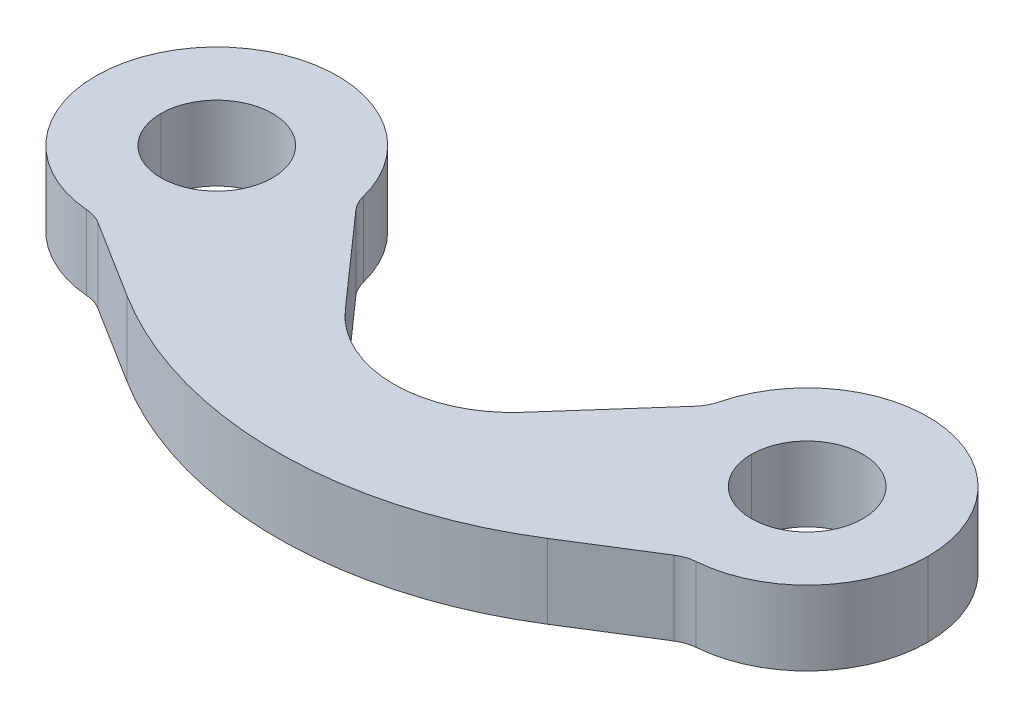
ISO-10303-21;
HEADER;
FILE_DESCRIPTION(('STEP AP214'),'2;1');
FILE_NAME('part.step','',(''),(''),'','','');
FILE_SCHEMA(('AUTOMOTIVE_DESIGN { 1 0 10303 214 1 1 1 1 }'));
ENDSEC;
DATA;
#1=APPLICATION_CONTEXT('core data for automotive mechanical design processes');
#2=APPLICATION_PROTOCOL_DEFINITION('international standard','automotive_design',2000,#1);
#3=PRODUCT_CONTEXT('',#1,'mechanical');
#4=PRODUCT('Part','Part','',(#3));
#5=PRODUCT_RELATED_PRODUCT_CATEGORY('part','',(#4));
#6=PRODUCT_DEFINITION_FORMATION('','',#4);
#7=PRODUCT_DEFINITION_CONTEXT('part definition',#1,'design');
#8=PRODUCT_DEFINITION('design','',#6,#7);
#9=PRODUCT_DEFINITION_SHAPE('','',#8);
#10=(LENGTH_UNIT() NAMED_UNIT(*) SI_UNIT(.MILLI.,.METRE.));
#11=(NAMED_UNIT(*) PLANE_ANGLE_UNIT() SI_UNIT($,.RADIAN.));
#12=(NAMED_UNIT(*) SI_UNIT($,.STERADIAN.) SOLID_ANGLE_UNIT());
#13=UNCERTAINTY_MEASURE_WITH_UNIT(LENGTH_MEASURE(1.E-05),#10,'distance_accuracy_value','');
#14=(GEOMETRIC_REPRESENTATION_CONTEXT(3) GLOBAL_UNCERTAINTY_ASSIGNED_CONTEXT((#13)) GLOBAL_UNIT_ASSIGNED_CONTEXT((#10,
#11,#12)) REPRESENTATION_CONTEXT('',''));
#15=CARTESIAN_POINT('',(0.,0.,0.));
#16=DIRECTION('',(0.,0.,1.));
#17=DIRECTION('',(1.,0.,0.));
#18=AXIS2_PLACEMENT_3D('',#15,#16,#17);
#19=CARTESIAN_POINT('',(0.,0.999999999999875,0.));
#20=DIRECTION('',(0.,-1.,0.));
#21=DIRECTION('',(1.,0.,0.));
#22=AXIS2_PLACEMENT_3D('',#19,#20,#21);
#23=CYLINDRICAL_SURFACE('',#22,1.50000000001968);
#24=CARTESIAN_POINT('',(0.,0.999999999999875,0.));
#25=DIRECTION('',(0.,-1.,0.));
#26=DIRECTION('',(1.,0.,0.));
#27=AXIS2_PLACEMENT_3D('',#24,#25,#26);
#28=CIRCLE('',#27,1.50000000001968);
#29=CARTESIAN_POINT('',(-1.50000000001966,0.999999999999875,0.));
#30=VERTEX_POINT('',#29);
#31=CARTESIAN_POINT('',(1.50000000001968,0.999999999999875,0.));
#32=VERTEX_POINT('',#31);
#33=EDGE_CURVE('E41',#30,#32,#28,.T.);
#34=ORIENTED_EDGE('',*,*,#33,.F.);
#35=DIRECTION('',(0.,-1.,0.));
#36=VECTOR('',#35,1.);
#37=CARTESIAN_POINT('',(-1.50000000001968,0.999999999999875,0.));
#38=LINE('',#37,#36);
#39=CARTESIAN_POINT('',(-1.50000000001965,-1.00000000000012,0.));
#40=VERTEX_POINT('',#39);
#41=EDGE_CURVE('E11',#30,#40,#38,.T.);
#42=ORIENTED_EDGE('',*,*,#41,.T.);
#43=CARTESIAN_POINT('',(0.,-1.00000000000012,0.));
#44=DIRECTION('',(0.,-1.,0.));
#45=DIRECTION('',(1.,0.,0.));
#46=AXIS2_PLACEMENT_3D('',#43,#44,#45);
#47=CIRCLE('',#46,1.50000000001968);
#48=CARTESIAN_POINT('',(1.50000000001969,-1.00000000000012,0.));
#49=VERTEX_POINT('',#48);
#50=EDGE_CURVE('E27',#40,#49,#47,.T.);
#51=ORIENTED_EDGE('',*,*,#50,.T.);
#52=DIRECTION('',(0.,-1.,0.));
#53=VECTOR('',#52,1.);
#54=CARTESIAN_POINT('',(1.50000000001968,0.999999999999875,0.));
#55=LINE('',#54,#53);
#56=EDGE_CURVE('E116',#32,#49,#55,.T.);
#57=ORIENTED_EDGE('',*,*,#56,.F.);
#58=EDGE_LOOP('',(#34,#42,#51,#57));
#59=FACE_BOUND('',#58,.T.);
#60=ADVANCED_FACE('F17',(#59),#23,.F.);
#61=CARTESIAN_POINT('',(15.8750000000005,0.99999999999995,1.59594559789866E-13));
#62=DIRECTION('',(0.,-1.,0.));
#63=DIRECTION('',(1.,0.,0.));
#64=AXIS2_PLACEMENT_3D('',#61,#62,#63);
#65=CYLINDRICAL_SURFACE('',#64,1.50000000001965);
#66=CARTESIAN_POINT('',(15.8750000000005,0.99999999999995,1.59594559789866E-13));
#67=DIRECTION('',(0.,-1.,0.));
#68=DIRECTION('',(1.,0.,0.));
#69=AXIS2_PLACEMENT_3D('',#66,#67,#68);
#70=CIRCLE('',#69,1.50000000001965);
#71=CARTESIAN_POINT('',(14.3749999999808,0.99999999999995,1.59594559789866E-13));
#72=VERTEX_POINT('',#71);
#73=CARTESIAN_POINT('',(17.3750000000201,0.99999999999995,1.59594559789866E-13));
#74=VERTEX_POINT('',#73);
#75=EDGE_CURVE('E131',#72,#74,#70,.T.);
#76=ORIENTED_EDGE('',*,*,#75,.F.);
#77=DIRECTION('',(0.,-1.,0.));
#78=VECTOR('',#77,1.);
#79=CARTESIAN_POINT('',(14.3749999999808,0.99999999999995,1.59594559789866E-13));
#80=LINE('',#79,#78);
#81=CARTESIAN_POINT('',(14.3749999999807,-1.00000000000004,1.59594559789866E-13));
#82=VERTEX_POINT('',#81);
#83=EDGE_CURVE('E303',#72,#82,#80,.T.);
#84=ORIENTED_EDGE('',*,*,#83,.T.);
#85=CARTESIAN_POINT('',(15.8750000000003,-1.00000000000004,0.));
#86=DIRECTION('',(0.,-1.,0.));
#87=DIRECTION('',(1.,0.,0.));
#88=AXIS2_PLACEMENT_3D('',#85,#86,#87);
#89=CIRCLE('',#88,1.50000000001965);
#90=CARTESIAN_POINT('',(17.37500000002,-1.00000000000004,0.));
#91=VERTEX_POINT('',#90);
#92=EDGE_CURVE('E237',#82,#91,#89,.T.);
#93=ORIENTED_EDGE('',*,*,#92,.T.);
#94=DIRECTION('',(0.,-1.,0.));
#95=VECTOR('',#94,1.);
#96=CARTESIAN_POINT('',(17.3750000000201,0.99999999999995,1.59594559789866E-13));
#97=LINE('',#96,#95);
#98=EDGE_CURVE('E282',#74,#91,#97,.T.);
#99=ORIENTED_EDGE('',*,*,#98,.F.);
#100=EDGE_LOOP('',(#76,#84,#93,#99));
#101=FACE_BOUND('',#100,.T.);
#102=ADVANCED_FACE('F543',(#101),#65,.F.);
#103=CARTESIAN_POINT('',(15.8750000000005,0.99999999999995,1.59594559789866E-13));
#104=DIRECTION('',(0.,-1.,0.));
#105=DIRECTION('',(1.,0.,0.));
#106=AXIS2_PLACEMENT_3D('',#103,#104,#105);
#107=CYLINDRICAL_SURFACE('',#106,3.25);
#108=CARTESIAN_POINT('',(15.8750000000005,0.99999999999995,1.59594559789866E-13));
#109=DIRECTION('',(0.,-1.,0.));
#110=DIRECTION('',(1.,0.,0.));
#111=AXIS2_PLACEMENT_3D('',#108,#109,#110);
#112=CIRCLE('',#111,3.25);
#113=CARTESIAN_POINT('',(12.721244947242,1.00000000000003,-0.785066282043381));
#114=VERTEX_POINT('',#113);
#115=CARTESIAN_POINT('',(19.1250000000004,0.99999999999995,1.59594559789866E-13));
#116=VERTEX_POINT('',#115);
#117=EDGE_CURVE('E314',#114,#116,#112,.T.);
#118=ORIENTED_EDGE('',*,*,#117,.T.);
#119=DIRECTION('',(0.,-1.,0.));
#120=VECTOR('',#119,1.);
#121=CARTESIAN_POINT('',(19.1250000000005,0.99999999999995,1.59594559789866E-13));
#122=LINE('',#121,#120);
#123=CARTESIAN_POINT('',(19.1250000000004,-1.00000000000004,1.59594559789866E-13));
#124=VERTEX_POINT('',#123);
#125=EDGE_CURVE('E215',#116,#124,#122,.T.);
#126=ORIENTED_EDGE('',*,*,#125,.T.);
#127=CARTESIAN_POINT('',(15.8750000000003,-1.00000000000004,0.));
#128=DIRECTION('',(0.,-1.,0.));
#129=DIRECTION('',(1.,0.,0.));
#130=AXIS2_PLACEMENT_3D('',#127,#128,#129);
#131=CIRCLE('',#130,3.25);
#132=CARTESIAN_POINT('',(12.721244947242,-0.999999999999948,-0.78506628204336));
#133=VERTEX_POINT('',#132);
#134=EDGE_CURVE('E206',#133,#124,#131,.T.);
#135=ORIENTED_EDGE('',*,*,#134,.F.);
#136=DIRECTION('',(0.,-1.,0.));
#137=VECTOR('',#136,1.);
#138=CARTESIAN_POINT('',(12.721244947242,1.00000000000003,-0.785066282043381));
#139=LINE('',#138,#137);
#140=EDGE_CURVE('E20',#114,#133,#139,.T.);
#141=ORIENTED_EDGE('',*,*,#140,.F.);
#142=EDGE_LOOP('',(#118,#126,#135,#141));
#143=FACE_BOUND('',#142,.T.);
#144=ADVANCED_FACE('F213',(#143),#107,.T.);
#145=CARTESIAN_POINT('',(16.2114974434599,1.,4.23665781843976));
#146=DIRECTION('',(0.,-1.,0.));
#147=DIRECTION('',(1.,0.,0.));
#148=AXIS2_PLACEMENT_3D('',#145,#146,#147);
#149=CYLINDRICAL_SURFACE('',#148,1.00000000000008);
#150=CARTESIAN_POINT('',(16.21149744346,-0.999999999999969,4.23665781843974));
#151=DIRECTION('',(0.,1.,0.));
#152=DIRECTION('',(1.,0.,0.));
#153=AXIS2_PLACEMENT_3D('',#150,#151,#152);
#154=CIRCLE('',#153,1.00000000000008);
#155=CARTESIAN_POINT('',(16.1323215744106,-1.00000000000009,3.23979715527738));
#156=VERTEX_POINT('',#155);
#157=CARTESIAN_POINT('',(15.6804523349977,-0.999999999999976,3.38931426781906));
#158=VERTEX_POINT('',#157);
#159=EDGE_CURVE('E299',#156,#158,#154,.T.);
#160=ORIENTED_EDGE('',*,*,#159,.F.);
#161=DIRECTION('',(0.,-1.,0.));
#162=VECTOR('',#161,1.);
#163=CARTESIAN_POINT('',(16.1323215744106,0.999999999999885,3.2397971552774));
#164=LINE('',#163,#162);
#165=CARTESIAN_POINT('',(16.1323215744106,0.999999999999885,3.2397971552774));
#166=VERTEX_POINT('',#165);
#167=EDGE_CURVE('E266',#166,#156,#164,.T.);
#168=ORIENTED_EDGE('',*,*,#167,.F.);
#169=CARTESIAN_POINT('',(16.2114974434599,1.,4.23665781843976));
#170=DIRECTION('',(0.,1.,0.));
#171=DIRECTION('',(1.,0.,0.));
#172=AXIS2_PLACEMENT_3D('',#169,#170,#171);
#173=CIRCLE('',#172,1.00000000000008);
#174=CARTESIAN_POINT('',(15.6804523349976,1.,3.38931426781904));
#175=VERTEX_POINT('',#174);
#176=EDGE_CURVE('E273',#166,#175,#173,.T.);
#177=ORIENTED_EDGE('',*,*,#176,.T.);
#178=DIRECTION('',(0.,-1.,0.));
#179=VECTOR('',#178,1.);
#180=CARTESIAN_POINT('',(15.6804523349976,1.,3.38931426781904));
#181=LINE('',#180,#179);
#182=EDGE_CURVE('E265',#175,#158,#181,.T.);
#183=ORIENTED_EDGE('',*,*,#182,.T.);
#184=EDGE_LOOP('',(#160,#168,#177,#183));
#185=FACE_BOUND('',#184,.T.);
#186=ADVANCED_FACE('F380',(#185),#149,.F.);
#187=CARTESIAN_POINT('',(15.8750000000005,0.99999999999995,1.59594559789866E-13));
#188=DIRECTION('',(0.,-1.,0.));
#189=DIRECTION('',(1.,0.,0.));
#190=AXIS2_PLACEMENT_3D('',#187,#188,#189);
#191=CYLINDRICAL_SURFACE('',#190,3.25);
#192=ORIENTED_EDGE('',*,*,#125,.F.);
#193=CARTESIAN_POINT('',(15.8750000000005,0.99999999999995,1.59594559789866E-13));
#194=DIRECTION('',(0.,-1.,0.));
#195=DIRECTION('',(1.,0.,0.));
#196=AXIS2_PLACEMENT_3D('',#193,#194,#195);
#197=CIRCLE('',#196,3.25);
#198=EDGE_CURVE('E261',#116,#166,#197,.T.);
#199=ORIENTED_EDGE('',*,*,#198,.T.);
#200=ORIENTED_EDGE('',*,*,#167,.T.);
#201=CARTESIAN_POINT('',(15.8750000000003,-1.00000000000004,0.));
#202=DIRECTION('',(0.,-1.,0.));
#203=DIRECTION('',(1.,0.,0.));
#204=AXIS2_PLACEMENT_3D('',#201,#202,#203);
#205=CIRCLE('',#204,3.25);
#206=EDGE_CURVE('E219',#124,#156,#205,.T.);
#207=ORIENTED_EDGE('',*,*,#206,.F.);
#208=EDGE_LOOP('',(#192,#199,#200,#207));
#209=FACE_BOUND('',#208,.T.);
#210=ADVANCED_FACE('F373',(#209),#191,.T.);
#211=CARTESIAN_POINT('',(11.7508587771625,0.999999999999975,-1.02662513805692));
#212=DIRECTION('',(0.,-1.,0.));
#213=DIRECTION('',(1.,0.,0.));
#214=AXIS2_PLACEMENT_3D('',#211,#212,#213);
#215=CYLINDRICAL_SURFACE('',#214,1.00000000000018);
#216=CARTESIAN_POINT('',(11.7508587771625,-0.999999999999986,-1.02662513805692));
#217=DIRECTION('',(0.,1.,0.));
#218=DIRECTION('',(1.,0.,0.));
#219=AXIS2_PLACEMENT_3D('',#216,#217,#218);
#220=CIRCLE('',#219,1.00000000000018);
#221=CARTESIAN_POINT('',(12.4996587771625,-1.00000000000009,-0.36382912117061));
#222=VERTEX_POINT('',#221);
#223=EDGE_CURVE('E218',#222,#133,#220,.T.);
#224=ORIENTED_EDGE('',*,*,#223,.F.);
#225=DIRECTION('',(0.,-1.,0.));
#226=VECTOR('',#225,1.);
#227=CARTESIAN_POINT('',(12.4996587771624,0.999999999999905,-0.36382912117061));
#228=LINE('',#227,#226);
#229=CARTESIAN_POINT('',(12.4996587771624,0.999999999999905,-0.36382912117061));
#230=VERTEX_POINT('',#229);
#231=EDGE_CURVE('E88',#230,#222,#228,.T.);
#232=ORIENTED_EDGE('',*,*,#231,.F.);
#233=CARTESIAN_POINT('',(11.7508587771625,0.999999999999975,-1.02662513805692));
#234=DIRECTION('',(0.,1.,0.));
#235=DIRECTION('',(1.,0.,0.));
#236=AXIS2_PLACEMENT_3D('',#233,#234,#235);
#237=CIRCLE('',#236,1.00000000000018);
#238=EDGE_CURVE('E222',#230,#114,#237,.T.);
#239=ORIENTED_EDGE('',*,*,#238,.T.);
#240=ORIENTED_EDGE('',*,*,#140,.T.);
#241=EDGE_LOOP('',(#224,#232,#239,#240));
#242=FACE_BOUND('',#241,.T.);
#243=ADVANCED_FACE('F221',(#242),#215,.F.);
#244=CARTESIAN_POINT('',(12.4996587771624,0.999999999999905,-0.36382912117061));
#245=DIRECTION('',(-0.7488,0.,-0.662796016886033));
#246=DIRECTION('',(-0.662796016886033,0.,0.7488));
#247=AXIS2_PLACEMENT_3D('',#244,#245,#246);
#248=PLANE('',#247);
#249=DIRECTION('',(0.662796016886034,0.,-0.7488));
#250=VECTOR('',#249,1.);
#251=CARTESIAN_POINT('',(12.4996587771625,-1.00000000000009,-0.36382912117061));
#252=LINE('',#251,#250);
#253=CARTESIAN_POINT('',(10.3149400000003,-1.,2.10437735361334));
#254=VERTEX_POINT('',#253);
#255=EDGE_CURVE('E75',#254,#222,#252,.T.);
#256=ORIENTED_EDGE('',*,*,#255,.F.);
#257=DIRECTION('',(0.,-1.,0.));
#258=VECTOR('',#257,1.);
#259=CARTESIAN_POINT('',(10.3149400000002,1.,2.10437735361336));
#260=LINE('',#259,#258);
#261=CARTESIAN_POINT('',(10.3149400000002,1.,2.10437735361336));
#262=VERTEX_POINT('',#261);
#263=EDGE_CURVE('E241',#262,#254,#260,.T.);
#264=ORIENTED_EDGE('',*,*,#263,.F.);
#265=DIRECTION('',(0.662796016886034,0.,-0.7488));
#266=VECTOR('',#265,1.);
#267=CARTESIAN_POINT('',(12.4996587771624,0.999999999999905,-0.36382912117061));
#268=LINE('',#267,#266);
#269=EDGE_CURVE('E224',#262,#230,#268,.T.);
#270=ORIENTED_EDGE('',*,*,#269,.T.);
#271=ORIENTED_EDGE('',*,*,#231,.T.);
#272=EDGE_LOOP('',(#256,#264,#270,#271));
#273=FACE_BOUND('',#272,.T.);
#274=ADVANCED_FACE('F567',(#273),#248,.T.);
#275=CARTESIAN_POINT('',(7.93750000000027,0.99999999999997,0.));
#276=DIRECTION('',(0.,-1.,0.));
#277=DIRECTION('',(1.,0.,0.));
#278=AXIS2_PLACEMENT_3D('',#275,#276,#277);
#279=CYLINDRICAL_SURFACE('',#278,3.17500000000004);
#280=CARTESIAN_POINT('',(7.93750000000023,-1.00000000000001,0.));
#281=DIRECTION('',(0.,1.,0.));
#282=DIRECTION('',(1.,0.,0.));
#283=AXIS2_PLACEMENT_3D('',#280,#281,#282);
#284=CIRCLE('',#283,3.17500000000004);
#285=CARTESIAN_POINT('',(5.56006000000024,-0.999999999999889,2.10437735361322));
#286=VERTEX_POINT('',#285);
#287=EDGE_CURVE('E162',#286,#254,#284,.T.);
#288=ORIENTED_EDGE('',*,*,#287,.F.);
#289=DIRECTION('',(0.,-1.,0.));
#290=VECTOR('',#289,1.);
#291=CARTESIAN_POINT('',(5.56006000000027,1.0000000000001,2.10437735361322));
#292=LINE('',#291,#290);
#293=CARTESIAN_POINT('',(5.56006000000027,1.0000000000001,2.10437735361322));
#294=VERTEX_POINT('',#293);
#295=EDGE_CURVE('E169',#294,#286,#292,.T.);
#296=ORIENTED_EDGE('',*,*,#295,.F.);
#297=CARTESIAN_POINT('',(7.93750000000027,0.99999999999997,0.));
#298=DIRECTION('',(0.,1.,0.));
#299=DIRECTION('',(1.,0.,0.));
#300=AXIS2_PLACEMENT_3D('',#297,#298,#299);
#301=CIRCLE('',#300,3.17500000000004);
#302=EDGE_CURVE('E239',#294,#262,#301,.T.);
#303=ORIENTED_EDGE('',*,*,#302,.T.);
#304=ORIENTED_EDGE('',*,*,#263,.T.);
#305=EDGE_LOOP('',(#288,#296,#303,#304));
#306=FACE_BOUND('',#305,.T.);
#307=ADVANCED_FACE('F569',(#306),#279,.F.);
#308=CARTESIAN_POINT('',(5.56006000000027,1.0000000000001,2.10437735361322));
#309=DIRECTION('',(0.7488,0.,-0.662796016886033));
#310=DIRECTION('',(0.,1.,0.));
#311=AXIS2_PLACEMENT_3D('',#308,#309,#310);
#312=PLANE('',#311);
#313=DIRECTION('',(0.662796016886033,0.,0.7488));
#314=VECTOR('',#313,1.);
#315=CARTESIAN_POINT('',(5.56006000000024,-0.999999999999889,2.10437735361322));
#316=LINE('',#315,#314);
#317=CARTESIAN_POINT('',(3.37534122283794,-1.,-0.363829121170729));
#318=VERTEX_POINT('',#317);
#319=EDGE_CURVE('E296',#318,#286,#316,.T.);
#320=ORIENTED_EDGE('',*,*,#319,.F.);
#321=DIRECTION('',(0.,-1.,0.));
#322=VECTOR('',#321,1.);
#323=CARTESIAN_POINT('',(3.375341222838,1.,-0.363829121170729));
#324=LINE('',#323,#322);
#325=CARTESIAN_POINT('',(3.375341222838,1.,-0.363829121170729));
#326=VERTEX_POINT('',#325);
#327=EDGE_CURVE('E254',#326,#318,#324,.T.);
#328=ORIENTED_EDGE('',*,*,#327,.F.);
#329=DIRECTION('',(0.662796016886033,0.,0.7488));
#330=VECTOR('',#329,1.);
#331=CARTESIAN_POINT('',(5.56006000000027,1.0000000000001,2.10437735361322));
#332=LINE('',#331,#330);
#333=EDGE_CURVE('E318',#326,#294,#332,.T.);
#334=ORIENTED_EDGE('',*,*,#333,.T.);
#335=ORIENTED_EDGE('',*,*,#295,.T.);
#336=EDGE_LOOP('',(#320,#328,#334,#335));
#337=FACE_BOUND('',#336,.T.);
#338=ADVANCED_FACE('F516',(#337),#312,.T.);
#339=CARTESIAN_POINT('',(4.12414122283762,0.999999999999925,-1.02662513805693));
#340=DIRECTION('',(0.,-1.,0.));
#341=DIRECTION('',(1.,0.,0.));
#342=AXIS2_PLACEMENT_3D('',#339,#340,#341);
#343=CYLINDRICAL_SURFACE('',#342,0.999999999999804);
#344=CARTESIAN_POINT('',(4.12414122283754,-1.00000000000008,-1.02662513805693));
#345=DIRECTION('',(0.,1.,0.));
#346=DIRECTION('',(1.,0.,0.));
#347=AXIS2_PLACEMENT_3D('',#344,#345,#346);
#348=CIRCLE('',#347,0.999999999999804);
#349=CARTESIAN_POINT('',(3.15375505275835,-0.999999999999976,-0.7850662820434));
#350=VERTEX_POINT('',#349);
#351=EDGE_CURVE('E342',#350,#318,#348,.T.);
#352=ORIENTED_EDGE('',*,*,#351,.F.);
#353=DIRECTION('',(0.,-1.,0.));
#354=VECTOR('',#353,1.);
#355=CARTESIAN_POINT('',(3.15375505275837,1.,-0.785066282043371));
#356=LINE('',#355,#354);
#357=CARTESIAN_POINT('',(3.15375505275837,1.,-0.785066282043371));
#358=VERTEX_POINT('',#357);
#359=EDGE_CURVE('E271',#358,#350,#356,.T.);
#360=ORIENTED_EDGE('',*,*,#359,.F.);
#361=CARTESIAN_POINT('',(4.12414122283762,0.999999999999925,-1.02662513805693));
#362=DIRECTION('',(0.,1.,0.));
#363=DIRECTION('',(1.,0.,0.));
#364=AXIS2_PLACEMENT_3D('',#361,#362,#363);
#365=CIRCLE('',#364,0.999999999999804);
#366=EDGE_CURVE('E250',#358,#326,#365,.T.);
#367=ORIENTED_EDGE('',*,*,#366,.T.);
#368=ORIENTED_EDGE('',*,*,#327,.T.);
#369=EDGE_LOOP('',(#352,#360,#367,#368));
#370=FACE_BOUND('',#369,.T.);
#371=ADVANCED_FACE('F522',(#370),#343,.F.);
#372=CARTESIAN_POINT('',(0.,0.999999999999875,0.));
#373=DIRECTION('',(0.,-1.,0.));
#374=DIRECTION('',(1.,0.,0.));
#375=AXIS2_PLACEMENT_3D('',#372,#373,#374);
#376=CYLINDRICAL_SURFACE('',#375,3.25);
#377=CARTESIAN_POINT('',(0.,-1.00000000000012,0.));
#378=DIRECTION('',(0.,-1.,0.));
#379=DIRECTION('',(1.,0.,0.));
#380=AXIS2_PLACEMENT_3D('',#377,#378,#379);
#381=CIRCLE('',#380,3.25);
#382=CARTESIAN_POINT('',(-0.257321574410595,-0.999999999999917,3.23979715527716));
#383=VERTEX_POINT('',#382);
#384=EDGE_CURVE('E289',#383,#350,#381,.T.);
#385=ORIENTED_EDGE('',*,*,#384,.F.);
#386=DIRECTION('',(0.,-1.,0.));
#387=VECTOR('',#386,1.);
#388=CARTESIAN_POINT('',(-0.257321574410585,1.,3.23979715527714));
#389=LINE('',#388,#387);
#390=CARTESIAN_POINT('',(-0.257321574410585,1.,3.23979715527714));
#391=VERTEX_POINT('',#390);
#392=EDGE_CURVE('E272',#391,#383,#389,.T.);
#393=ORIENTED_EDGE('',*,*,#392,.F.);
#394=CARTESIAN_POINT('',(0.,0.999999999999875,0.));
#395=DIRECTION('',(0.,-1.,0.));
#396=DIRECTION('',(1.,0.,0.));
#397=AXIS2_PLACEMENT_3D('',#394,#395,#396);
#398=CIRCLE('',#397,3.25);
#399=EDGE_CURVE('E338',#391,#358,#398,.T.);
#400=ORIENTED_EDGE('',*,*,#399,.T.);
#401=ORIENTED_EDGE('',*,*,#359,.T.);
#402=EDGE_LOOP('',(#385,#393,#400,#401));
#403=FACE_BOUND('',#402,.T.);
#404=ADVANCED_FACE('F524',(#403),#376,.T.);
#405=CARTESIAN_POINT('',(-0.336497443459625,1.00000000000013,4.2366578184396));
#406=DIRECTION('',(0.,-1.,0.));
#407=DIRECTION('',(1.,0.,0.));
#408=AXIS2_PLACEMENT_3D('',#405,#406,#407);
#409=CYLINDRICAL_SURFACE('',#408,1.);
#410=CARTESIAN_POINT('',(-0.336497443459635,-0.999999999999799,4.2366578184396));
#411=DIRECTION('',(0.,1.,0.));
#412=DIRECTION('',(1.,0.,0.));
#413=AXIS2_PLACEMENT_3D('',#410,#411,#412);
#414=CIRCLE('',#413,1.);
#415=CARTESIAN_POINT('',(0.194547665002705,-0.999999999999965,3.38931426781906));
#416=VERTEX_POINT('',#415);
#417=EDGE_CURVE('E260',#416,#383,#414,.T.);
#418=ORIENTED_EDGE('',*,*,#417,.F.);
#419=DIRECTION('',(0.,-1.,0.));
#420=VECTOR('',#419,1.);
#421=CARTESIAN_POINT('',(0.19454766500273,1.00000000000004,3.3893142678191));
#422=LINE('',#421,#420);
#423=CARTESIAN_POINT('',(0.19454766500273,1.00000000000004,3.3893142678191));
#424=VERTEX_POINT('',#423);
#425=EDGE_CURVE('E321',#424,#416,#422,.T.);
#426=ORIENTED_EDGE('',*,*,#425,.F.);
#427=CARTESIAN_POINT('',(-0.336497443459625,1.00000000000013,4.2366578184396));
#428=DIRECTION('',(0.,1.,0.));
#429=DIRECTION('',(1.,0.,0.));
#430=AXIS2_PLACEMENT_3D('',#427,#428,#429);
#431=CIRCLE('',#430,1.);
#432=EDGE_CURVE('E267',#424,#391,#431,.T.);
#433=ORIENTED_EDGE('',*,*,#432,.T.);
#434=ORIENTED_EDGE('',*,*,#392,.T.);
#435=EDGE_LOOP('',(#418,#426,#433,#434));
#436=FACE_BOUND('',#435,.T.);
#437=ADVANCED_FACE('F526',(#436),#409,.F.);
#438=CARTESIAN_POINT('',(0.19454766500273,1.00000000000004,3.3893142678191));
#439=DIRECTION('',(-0.531045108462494,0.,0.847343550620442));
#440=DIRECTION('',(0.,-1.,0.));
#441=AXIS2_PLACEMENT_3D('',#438,#439,#440);
#442=PLANE('',#441);
#443=DIRECTION('',(-0.847343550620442,0.,-0.531045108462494));
#444=VECTOR('',#443,1.);
#445=CARTESIAN_POINT('',(0.194547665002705,-0.999999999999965,3.38931426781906));
#446=LINE('',#445,#444);
#447=CARTESIAN_POINT('',(2.2857993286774,-1.00000000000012,4.69993847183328));
#448=VERTEX_POINT('',#447);
#449=EDGE_CURVE('E255',#448,#416,#446,.T.);
#450=ORIENTED_EDGE('',*,*,#449,.F.);
#451=DIRECTION('',(0.,-1.,0.));
#452=VECTOR('',#451,1.);
#453=CARTESIAN_POINT('',(2.28579932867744,0.99999999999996,4.69993847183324));
#454=LINE('',#453,#452);
#455=CARTESIAN_POINT('',(2.28579932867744,0.99999999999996,4.69993847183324));
#456=VERTEX_POINT('',#455);
#457=EDGE_CURVE('E367',#456,#448,#454,.T.);
#458=ORIENTED_EDGE('',*,*,#457,.F.);
#459=DIRECTION('',(-0.847343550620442,0.,-0.531045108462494));
#460=VECTOR('',#459,1.);
#461=CARTESIAN_POINT('',(0.19454766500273,1.00000000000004,3.3893142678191));
#462=LINE('',#461,#460);
#463=EDGE_CURVE('E325',#456,#424,#462,.T.);
#464=ORIENTED_EDGE('',*,*,#463,.T.);
#465=ORIENTED_EDGE('',*,*,#425,.T.);
#466=EDGE_LOOP('',(#450,#458,#464,#465));
#467=FACE_BOUND('',#466,.T.);
#468=ADVANCED_FACE('F529',(#467),#442,.T.);
#469=CARTESIAN_POINT('',(7.93750000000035,1.,-4.31800000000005));
#470=DIRECTION('',(0.,-1.,0.));
#471=DIRECTION('',(1.,0.,0.));
#472=AXIS2_PLACEMENT_3D('',#469,#470,#471);
#473=CYLINDRICAL_SURFACE('',#472,10.6426);
#474=CARTESIAN_POINT('',(7.93750000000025,-1.,-4.31800000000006));
#475=DIRECTION('',(0.,-1.,0.));
#476=DIRECTION('',(1.,0.,0.));
#477=AXIS2_PLACEMENT_3D('',#474,#475,#476);
#478=CIRCLE('',#477,10.6426);
#479=CARTESIAN_POINT('',(13.5892006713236,-0.999999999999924,4.69993847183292));
#480=VERTEX_POINT('',#479);
#481=EDGE_CURVE('E259',#480,#448,#478,.T.);
#482=ORIENTED_EDGE('',*,*,#481,.F.);
#483=DIRECTION('',(0.,-1.,0.));
#484=VECTOR('',#483,1.);
#485=CARTESIAN_POINT('',(13.5892006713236,1.00000000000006,4.69993847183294));
#486=LINE('',#485,#484);
#487=CARTESIAN_POINT('',(13.5892006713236,1.00000000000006,4.69993847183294));
#488=VERTEX_POINT('',#487);
#489=EDGE_CURVE('E332',#488,#480,#486,.T.);
#490=ORIENTED_EDGE('',*,*,#489,.F.);
#491=CARTESIAN_POINT('',(7.93750000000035,1.,-4.31800000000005));
#492=DIRECTION('',(0.,-1.,0.));
#493=DIRECTION('',(1.,0.,0.));
#494=AXIS2_PLACEMENT_3D('',#491,#492,#493);
#495=CIRCLE('',#494,10.6426);
#496=EDGE_CURVE('E326',#488,#456,#495,.T.);
#497=ORIENTED_EDGE('',*,*,#496,.T.);
#498=ORIENTED_EDGE('',*,*,#457,.T.);
#499=EDGE_LOOP('',(#482,#490,#497,#498));
#500=FACE_BOUND('',#499,.T.);
#501=ADVANCED_FACE('F531',(#500),#473,.T.);
#502=CARTESIAN_POINT('',(13.5892006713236,1.00000000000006,4.69993847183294));
#503=DIRECTION('',(0.531045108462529,0.,0.847343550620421));
#504=DIRECTION('',(0.,1.,0.));
#505=AXIS2_PLACEMENT_3D('',#502,#503,#504);
#506=PLANE('',#505);
#507=DIRECTION('',(-0.847343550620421,0.,0.531045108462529));
#508=VECTOR('',#507,1.);
#509=CARTESIAN_POINT('',(13.5892006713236,-0.999999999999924,4.69993847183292));
#510=LINE('',#509,#508);
#511=EDGE_CURVE('E292',#158,#480,#510,.T.);
#512=ORIENTED_EDGE('',*,*,#511,.F.);
#513=ORIENTED_EDGE('',*,*,#182,.F.);
#514=DIRECTION('',(-0.847343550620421,0.,0.531045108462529));
#515=VECTOR('',#514,1.);
#516=CARTESIAN_POINT('',(13.5892006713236,1.00000000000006,4.69993847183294));
#517=LINE('',#516,#515);
#518=EDGE_CURVE('E364',#175,#488,#517,.T.);
#519=ORIENTED_EDGE('',*,*,#518,.T.);
#520=ORIENTED_EDGE('',*,*,#489,.T.);
#521=EDGE_LOOP('',(#512,#513,#519,#520));
#522=FACE_BOUND('',#521,.T.);
#523=ADVANCED_FACE('F384',(#522),#506,.T.);
#524=CARTESIAN_POINT('',(16.2114974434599,1.,4.23665781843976));
#525=DIRECTION('',(0.,-1.,0.));
#526=DIRECTION('',(1.,0.,0.));
#527=AXIS2_PLACEMENT_3D('',#524,#525,#526);
#528=PLANE('',#527);
#529=ORIENTED_EDGE('',*,*,#176,.F.);
#530=ORIENTED_EDGE('',*,*,#198,.F.);
#531=ORIENTED_EDGE('',*,*,#117,.F.);
#532=ORIENTED_EDGE('',*,*,#238,.F.);
#533=ORIENTED_EDGE('',*,*,#269,.F.);
#534=ORIENTED_EDGE('',*,*,#302,.F.);
#535=ORIENTED_EDGE('',*,*,#333,.F.);
#536=ORIENTED_EDGE('',*,*,#366,.F.);
#537=ORIENTED_EDGE('',*,*,#399,.F.);
#538=ORIENTED_EDGE('',*,*,#432,.F.);
#539=ORIENTED_EDGE('',*,*,#463,.F.);
#540=ORIENTED_EDGE('',*,*,#496,.F.);
#541=ORIENTED_EDGE('',*,*,#518,.F.);
#542=EDGE_LOOP('',(#529,#530,#531,#532,#533,#534,#535,#536,#537,#538,#539,#540,#541));
#543=FACE_BOUND('',#542,.T.);
#544=CARTESIAN_POINT('',(0.,0.999999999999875,0.));
#545=DIRECTION('',(0.,-1.,0.));
#546=DIRECTION('',(1.,0.,0.));
#547=AXIS2_PLACEMENT_3D('',#544,#545,#546);
#548=CIRCLE('',#547,1.50000000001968);
#549=EDGE_CURVE('E243',#32,#30,#548,.T.);
#550=ORIENTED_EDGE('',*,*,#549,.T.);
#551=ORIENTED_EDGE('',*,*,#33,.T.);
#552=EDGE_LOOP('',(#550,#551));
#553=FACE_BOUND('',#552,.T.);
#554=CARTESIAN_POINT('',(15.8750000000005,0.99999999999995,1.59594559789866E-13));
#555=DIRECTION('',(0.,-1.,0.));
#556=DIRECTION('',(1.,0.,0.));
#557=AXIS2_PLACEMENT_3D('',#554,#555,#556);
#558=CIRCLE('',#557,1.50000000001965);
#559=EDGE_CURVE('E244',#74,#72,#558,.T.);
#560=ORIENTED_EDGE('',*,*,#559,.T.);
#561=ORIENTED_EDGE('',*,*,#75,.T.);
#562=EDGE_LOOP('',(#560,#561));
#563=FACE_BOUND('',#562,.T.);
#564=ADVANCED_FACE('F411',(#543,#553,#563),#528,.F.);
#565=CARTESIAN_POINT('',(16.21149744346,-0.999999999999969,4.23665781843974));
#566=DIRECTION('',(0.,-1.,0.));
#567=DIRECTION('',(1.,0.,0.));
#568=AXIS2_PLACEMENT_3D('',#565,#566,#567);
#569=PLANE('',#568);
#570=ORIENTED_EDGE('',*,*,#159,.T.);
#571=ORIENTED_EDGE('',*,*,#511,.T.);
#572=ORIENTED_EDGE('',*,*,#481,.T.);
#573=ORIENTED_EDGE('',*,*,#449,.T.);
#574=ORIENTED_EDGE('',*,*,#417,.T.);
#575=ORIENTED_EDGE('',*,*,#384,.T.);
#576=ORIENTED_EDGE('',*,*,#351,.T.);
#577=ORIENTED_EDGE('',*,*,#319,.T.);
#578=ORIENTED_EDGE('',*,*,#287,.T.);
#579=ORIENTED_EDGE('',*,*,#255,.T.);
#580=ORIENTED_EDGE('',*,*,#223,.T.);
#581=ORIENTED_EDGE('',*,*,#134,.T.);
#582=ORIENTED_EDGE('',*,*,#206,.T.);
#583=EDGE_LOOP('',(#570,#571,#572,#573,#574,#575,#576,#577,#578,#579,#580,#581,#582));
#584=FACE_BOUND('',#583,.T.);
#585=CARTESIAN_POINT('',(0.,-1.00000000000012,0.));
#586=DIRECTION('',(0.,-1.,0.));
#587=DIRECTION('',(1.,0.,0.));
#588=AXIS2_PLACEMENT_3D('',#585,#586,#587);
#589=CIRCLE('',#588,1.50000000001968);
#590=EDGE_CURVE('E249',#49,#40,#589,.T.);
#591=ORIENTED_EDGE('',*,*,#590,.F.);
#592=ORIENTED_EDGE('',*,*,#50,.F.);
#593=EDGE_LOOP('',(#591,#592));
#594=FACE_BOUND('',#593,.T.);
#595=CARTESIAN_POINT('',(15.8750000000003,-1.00000000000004,0.));
#596=DIRECTION('',(0.,-1.,0.));
#597=DIRECTION('',(1.,0.,0.));
#598=AXIS2_PLACEMENT_3D('',#595,#596,#597);
#599=CIRCLE('',#598,1.50000000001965);
#600=EDGE_CURVE('E248',#91,#82,#599,.T.);
#601=ORIENTED_EDGE('',*,*,#600,.F.);
#602=ORIENTED_EDGE('',*,*,#92,.F.);
#603=EDGE_LOOP('',(#601,#602));
#604=FACE_BOUND('',#603,.T.);
#605=ADVANCED_FACE('F225',(#584,#594,#604),#569,.T.);
#606=CARTESIAN_POINT('',(15.8750000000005,0.99999999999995,1.59594559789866E-13));
#607=DIRECTION('',(0.,-1.,0.));
#608=DIRECTION('',(1.,0.,0.));
#609=AXIS2_PLACEMENT_3D('',#606,#607,#608);
#610=CYLINDRICAL_SURFACE('',#609,1.50000000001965);
#611=ORIENTED_EDGE('',*,*,#83,.F.);
#612=ORIENTED_EDGE('',*,*,#559,.F.);
#613=ORIENTED_EDGE('',*,*,#98,.T.);
#614=ORIENTED_EDGE('',*,*,#600,.T.);
#615=EDGE_LOOP('',(#611,#612,#613,#614));
#616=FACE_BOUND('',#615,.T.);
#617=ADVANCED_FACE('F556',(#616),#610,.F.);
#618=CARTESIAN_POINT('',(0.,0.999999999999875,0.));
#619=DIRECTION('',(0.,-1.,0.));
#620=DIRECTION('',(1.,0.,0.));
#621=AXIS2_PLACEMENT_3D('',#618,#619,#620);
#622=CYLINDRICAL_SURFACE('',#621,1.50000000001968);
#623=ORIENTED_EDGE('',*,*,#41,.F.);
#624=ORIENTED_EDGE('',*,*,#549,.F.);
#625=ORIENTED_EDGE('',*,*,#56,.T.);
#626=ORIENTED_EDGE('',*,*,#590,.T.);
#627=EDGE_LOOP('',(#623,#624,#625,#626));
#628=FACE_BOUND('',#627,.T.);
#629=ADVANCED_FACE('F559',(#628),#622,.F.);
#630=CLOSED_SHELL('',(#60,#102,#144,#186,#210,#243,#274,#307,#338,#371,#404,#437,#468,#501,#523,
#564,#605,#617,#629));
#631=MANIFOLD_SOLID_BREP('B1',#630);
#632=ADVANCED_BREP_SHAPE_REPRESENTATION('',(#18,#631),#14);
#633=SHAPE_DEFINITION_REPRESENTATION(#9,#632);
ENDSEC;
END-ISO-10303-21;
